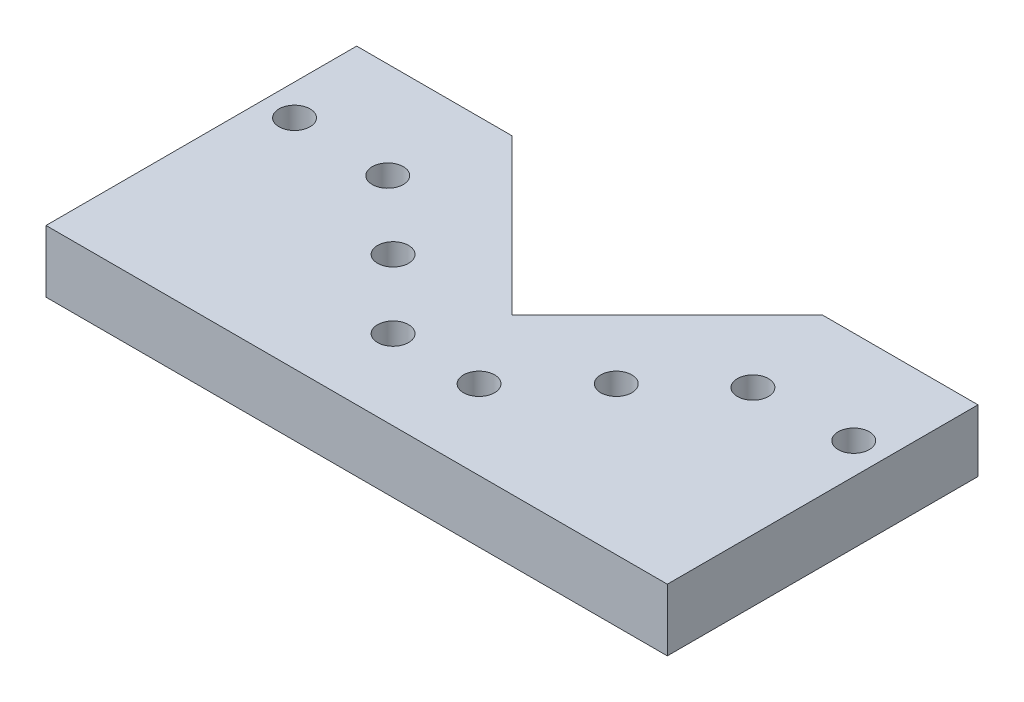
ISO-10303-21;
HEADER;
FILE_DESCRIPTION(('STEP AP214'),'2;1');
FILE_NAME('part.step','',(''),(''),'','','');
FILE_SCHEMA(('AUTOMOTIVE_DESIGN { 1 0 10303 214 1 1 1 1 }'));
ENDSEC;
DATA;
#1=APPLICATION_CONTEXT('core data for automotive mechanical design processes');
#2=APPLICATION_PROTOCOL_DEFINITION('international standard','automotive_design',2000,#1);
#3=PRODUCT_CONTEXT('',#1,'mechanical');
#4=PRODUCT('Part','Part','',(#3));
#5=PRODUCT_RELATED_PRODUCT_CATEGORY('part','',(#4));
#6=PRODUCT_DEFINITION_FORMATION('','',#4);
#7=PRODUCT_DEFINITION_CONTEXT('part definition',#1,'design');
#8=PRODUCT_DEFINITION('design','',#6,#7);
#9=PRODUCT_DEFINITION_SHAPE('','',#8);
#10=(LENGTH_UNIT() NAMED_UNIT(*) SI_UNIT(.MILLI.,.METRE.));
#11=(NAMED_UNIT(*) PLANE_ANGLE_UNIT() SI_UNIT($,.RADIAN.));
#12=(NAMED_UNIT(*) SI_UNIT($,.STERADIAN.) SOLID_ANGLE_UNIT());
#13=UNCERTAINTY_MEASURE_WITH_UNIT(LENGTH_MEASURE(1.E-05),#10,'distance_accuracy_value','');
#14=(GEOMETRIC_REPRESENTATION_CONTEXT(3) GLOBAL_UNCERTAINTY_ASSIGNED_CONTEXT((#13)) GLOBAL_UNIT_ASSIGNED_CONTEXT((#10,
#11,#12)) REPRESENTATION_CONTEXT('',''));
#15=CARTESIAN_POINT('',(0.,0.,0.));
#16=DIRECTION('',(0.,0.,1.));
#17=DIRECTION('',(1.,0.,0.));
#18=AXIS2_PLACEMENT_3D('',#15,#16,#17);
#19=CARTESIAN_POINT('',(0.,10.,0.));
#20=DIRECTION('',(-1.,0.,0.));
#21=DIRECTION('',(0.,0.,1.));
#22=AXIS2_PLACEMENT_3D('',#19,#20,#21);
#23=PLANE('',#22);
#24=DIRECTION('',(0.,0.,-1.));
#25=VECTOR('',#24,1.);
#26=CARTESIAN_POINT('',(0.,0.,0.));
#27=LINE('',#26,#25);
#28=CARTESIAN_POINT('',(0.,0.,0.));
#29=VERTEX_POINT('',#28);
#30=CARTESIAN_POINT('',(0.,0.,-50.));
#31=VERTEX_POINT('',#30);
#32=EDGE_CURVE('E95',#29,#31,#27,.T.);
#33=ORIENTED_EDGE('',*,*,#32,.T.);
#34=DIRECTION('',(0.,-1.,0.));
#35=VECTOR('',#34,1.);
#36=CARTESIAN_POINT('',(0.,10.,-50.));
#37=LINE('',#36,#35);
#38=CARTESIAN_POINT('',(0.,10.,-50.));
#39=VERTEX_POINT('',#38);
#40=EDGE_CURVE('E11',#39,#31,#37,.T.);
#41=ORIENTED_EDGE('',*,*,#40,.F.);
#42=DIRECTION('',(0.,0.,-1.));
#43=VECTOR('',#42,1.);
#44=CARTESIAN_POINT('',(0.,10.,0.));
#45=LINE('',#44,#43);
#46=CARTESIAN_POINT('',(0.,10.,0.));
#47=VERTEX_POINT('',#46);
#48=EDGE_CURVE('E125',#47,#39,#45,.T.);
#49=ORIENTED_EDGE('',*,*,#48,.F.);
#50=DIRECTION('',(0.,-1.,0.));
#51=VECTOR('',#50,1.);
#52=CARTESIAN_POINT('',(0.,10.,0.));
#53=LINE('',#52,#51);
#54=EDGE_CURVE('E108',#47,#29,#53,.T.);
#55=ORIENTED_EDGE('',*,*,#54,.T.);
#56=EDGE_LOOP('',(#33,#41,#49,#55));
#57=FACE_BOUND('',#56,.T.);
#58=ADVANCED_FACE('F33',(#57),#23,.F.);
#59=CARTESIAN_POINT('',(0.,10.,-50.));
#60=DIRECTION('',(0.,0.,1.));
#61=DIRECTION('',(1.,0.,0.));
#62=AXIS2_PLACEMENT_3D('',#59,#60,#61);
#63=PLANE('',#62);
#64=DIRECTION('',(-1.,0.,0.));
#65=VECTOR('',#64,1.);
#66=CARTESIAN_POINT('',(0.,0.,-50.));
#67=LINE('',#66,#65);
#68=CARTESIAN_POINT('',(-25.,0.,-50.));
#69=VERTEX_POINT('',#68);
#70=EDGE_CURVE('E91',#31,#69,#67,.T.);
#71=ORIENTED_EDGE('',*,*,#70,.T.);
#72=DIRECTION('',(0.,-1.,0.));
#73=VECTOR('',#72,1.);
#74=CARTESIAN_POINT('',(-25.,10.,-50.));
#75=LINE('',#74,#73);
#76=CARTESIAN_POINT('',(-25.,10.,-50.));
#77=VERTEX_POINT('',#76);
#78=EDGE_CURVE('E40',#77,#69,#75,.T.);
#79=ORIENTED_EDGE('',*,*,#78,.F.);
#80=DIRECTION('',(-1.,0.,0.));
#81=VECTOR('',#80,1.);
#82=CARTESIAN_POINT('',(0.,10.,-50.));
#83=LINE('',#82,#81);
#84=EDGE_CURVE('E104',#39,#77,#83,.T.);
#85=ORIENTED_EDGE('',*,*,#84,.F.);
#86=ORIENTED_EDGE('',*,*,#40,.T.);
#87=EDGE_LOOP('',(#71,#79,#85,#86));
#88=FACE_BOUND('',#87,.T.);
#89=ADVANCED_FACE('F103',(#88),#63,.F.);
#90=CARTESIAN_POINT('',(-50.,10.,-25.));
#91=DIRECTION('',(0.707106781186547,0.,0.707106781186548));
#92=DIRECTION('',(0.707106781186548,0.,-0.707106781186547));
#93=AXIS2_PLACEMENT_3D('',#90,#91,#92);
#94=PLANE('',#93);
#95=DIRECTION('',(-0.707106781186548,0.,0.707106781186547));
#96=VECTOR('',#95,1.);
#97=CARTESIAN_POINT('',(-50.,0.,-25.));
#98=LINE('',#97,#96);
#99=CARTESIAN_POINT('',(-50.,0.,-25.));
#100=VERTEX_POINT('',#99);
#101=EDGE_CURVE('E97',#69,#100,#98,.T.);
#102=ORIENTED_EDGE('',*,*,#101,.T.);
#103=DIRECTION('',(0.,-1.,0.));
#104=VECTOR('',#103,1.);
#105=CARTESIAN_POINT('',(-50.,10.,-25.));
#106=LINE('',#105,#104);
#107=CARTESIAN_POINT('',(-50.,10.,-25.));
#108=VERTEX_POINT('',#107);
#109=EDGE_CURVE('E146',#108,#100,#106,.T.);
#110=ORIENTED_EDGE('',*,*,#109,.F.);
#111=DIRECTION('',(-0.707106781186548,0.,0.707106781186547));
#112=VECTOR('',#111,1.);
#113=CARTESIAN_POINT('',(-50.,10.,-25.));
#114=LINE('',#113,#112);
#115=EDGE_CURVE('E128',#77,#108,#114,.T.);
#116=ORIENTED_EDGE('',*,*,#115,.F.);
#117=ORIENTED_EDGE('',*,*,#78,.T.);
#118=EDGE_LOOP('',(#102,#110,#116,#117));
#119=FACE_BOUND('',#118,.T.);
#120=ADVANCED_FACE('F150',(#119),#94,.F.);
#121=CARTESIAN_POINT('',(-75.,10.,-50.));
#122=DIRECTION('',(-0.707106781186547,0.,0.707106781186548));
#123=DIRECTION('',(0.707106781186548,0.,0.707106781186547));
#124=AXIS2_PLACEMENT_3D('',#121,#122,#123);
#125=PLANE('',#124);
#126=DIRECTION('',(-0.707106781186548,0.,-0.707106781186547));
#127=VECTOR('',#126,1.);
#128=CARTESIAN_POINT('',(-75.,0.,-50.));
#129=LINE('',#128,#127);
#130=CARTESIAN_POINT('',(-75.,0.,-50.));
#131=VERTEX_POINT('',#130);
#132=EDGE_CURVE('E117',#100,#131,#129,.T.);
#133=ORIENTED_EDGE('',*,*,#132,.T.);
#134=DIRECTION('',(0.,-1.,0.));
#135=VECTOR('',#134,1.);
#136=CARTESIAN_POINT('',(-75.,10.,-50.));
#137=LINE('',#136,#135);
#138=CARTESIAN_POINT('',(-75.,10.,-50.));
#139=VERTEX_POINT('',#138);
#140=EDGE_CURVE('E143',#139,#131,#137,.T.);
#141=ORIENTED_EDGE('',*,*,#140,.F.);
#142=DIRECTION('',(-0.707106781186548,0.,-0.707106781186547));
#143=VECTOR('',#142,1.);
#144=CARTESIAN_POINT('',(-75.,10.,-50.));
#145=LINE('',#144,#143);
#146=EDGE_CURVE('E130',#108,#139,#145,.T.);
#147=ORIENTED_EDGE('',*,*,#146,.F.);
#148=ORIENTED_EDGE('',*,*,#109,.T.);
#149=EDGE_LOOP('',(#133,#141,#147,#148));
#150=FACE_BOUND('',#149,.T.);
#151=ADVANCED_FACE('F158',(#150),#125,.F.);
#152=CARTESIAN_POINT('',(-75.,10.,-50.));
#153=DIRECTION('',(0.,0.,1.));
#154=DIRECTION('',(1.,0.,0.));
#155=AXIS2_PLACEMENT_3D('',#152,#153,#154);
#156=PLANE('',#155);
#157=DIRECTION('',(-1.,0.,0.));
#158=VECTOR('',#157,1.);
#159=CARTESIAN_POINT('',(-75.,0.,-50.));
#160=LINE('',#159,#158);
#161=CARTESIAN_POINT('',(-100.,0.,-50.));
#162=VERTEX_POINT('',#161);
#163=EDGE_CURVE('E119',#131,#162,#160,.T.);
#164=ORIENTED_EDGE('',*,*,#163,.T.);
#165=DIRECTION('',(0.,-1.,0.));
#166=VECTOR('',#165,1.);
#167=CARTESIAN_POINT('',(-100.,10.,-50.));
#168=LINE('',#167,#166);
#169=CARTESIAN_POINT('',(-100.,10.,-50.));
#170=VERTEX_POINT('',#169);
#171=EDGE_CURVE('E140',#170,#162,#168,.T.);
#172=ORIENTED_EDGE('',*,*,#171,.F.);
#173=DIRECTION('',(-1.,0.,0.));
#174=VECTOR('',#173,1.);
#175=CARTESIAN_POINT('',(-75.,10.,-50.));
#176=LINE('',#175,#174);
#177=EDGE_CURVE('E132',#139,#170,#176,.T.);
#178=ORIENTED_EDGE('',*,*,#177,.F.);
#179=ORIENTED_EDGE('',*,*,#140,.T.);
#180=EDGE_LOOP('',(#164,#172,#178,#179));
#181=FACE_BOUND('',#180,.T.);
#182=ADVANCED_FACE('F161',(#181),#156,.F.);
#183=CARTESIAN_POINT('',(-100.,10.,0.));
#184=DIRECTION('',(1.,0.,0.));
#185=DIRECTION('',(0.,0.,-1.));
#186=AXIS2_PLACEMENT_3D('',#183,#184,#185);
#187=PLANE('',#186);
#188=DIRECTION('',(0.,0.,1.));
#189=VECTOR('',#188,1.);
#190=CARTESIAN_POINT('',(-100.,0.,0.));
#191=LINE('',#190,#189);
#192=CARTESIAN_POINT('',(-100.,0.,0.));
#193=VERTEX_POINT('',#192);
#194=EDGE_CURVE('E121',#162,#193,#191,.T.);
#195=ORIENTED_EDGE('',*,*,#194,.T.);
#196=DIRECTION('',(0.,-1.,0.));
#197=VECTOR('',#196,1.);
#198=CARTESIAN_POINT('',(-100.,10.,0.));
#199=LINE('',#198,#197);
#200=CARTESIAN_POINT('',(-100.,10.,0.));
#201=VERTEX_POINT('',#200);
#202=EDGE_CURVE('E137',#201,#193,#199,.T.);
#203=ORIENTED_EDGE('',*,*,#202,.F.);
#204=DIRECTION('',(0.,0.,1.));
#205=VECTOR('',#204,1.);
#206=CARTESIAN_POINT('',(-100.,10.,0.));
#207=LINE('',#206,#205);
#208=EDGE_CURVE('E52',#170,#201,#207,.T.);
#209=ORIENTED_EDGE('',*,*,#208,.F.);
#210=ORIENTED_EDGE('',*,*,#171,.T.);
#211=EDGE_LOOP('',(#195,#203,#209,#210));
#212=FACE_BOUND('',#211,.T.);
#213=ADVANCED_FACE('F164',(#212),#187,.F.);
#214=CARTESIAN_POINT('',(0.,10.,0.));
#215=DIRECTION('',(0.,0.,-1.));
#216=DIRECTION('',(-1.,0.,0.));
#217=AXIS2_PLACEMENT_3D('',#214,#215,#216);
#218=PLANE('',#217);
#219=DIRECTION('',(1.,0.,0.));
#220=VECTOR('',#219,1.);
#221=CARTESIAN_POINT('',(0.,0.,0.));
#222=LINE('',#221,#220);
#223=EDGE_CURVE('E123',#193,#29,#222,.T.);
#224=ORIENTED_EDGE('',*,*,#223,.T.);
#225=ORIENTED_EDGE('',*,*,#54,.F.);
#226=DIRECTION('',(1.,0.,0.));
#227=VECTOR('',#226,1.);
#228=CARTESIAN_POINT('',(0.,10.,0.));
#229=LINE('',#228,#227);
#230=EDGE_CURVE('E47',#201,#47,#229,.T.);
#231=ORIENTED_EDGE('',*,*,#230,.F.);
#232=ORIENTED_EDGE('',*,*,#202,.T.);
#233=EDGE_LOOP('',(#224,#225,#231,#232));
#234=FACE_BOUND('',#233,.T.);
#235=ADVANCED_FACE('F166',(#234),#218,.F.);
#236=CARTESIAN_POINT('',(0.,10.,0.));
#237=DIRECTION('',(0.,1.,0.));
#238=DIRECTION('',(0.,0.,1.));
#239=AXIS2_PLACEMENT_3D('',#236,#237,#238);
#240=PLANE('',#239);
#241=CARTESIAN_POINT('',(-94.9999999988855,10.,-35.));
#242=DIRECTION('',(0.,1.,0.));
#243=DIRECTION('',(0.,0.,1.));
#244=AXIS2_PLACEMENT_3D('',#241,#242,#243);
#245=CIRCLE('',#244,2.5);
#246=CARTESIAN_POINT('',(-94.9999999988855,10.,-32.5));
#247=VERTEX_POINT('',#246);
#248=EDGE_CURVE('E305',#247,#247,#245,.T.);
#249=ORIENTED_EDGE('',*,*,#248,.F.);
#250=EDGE_LOOP('',(#249));
#251=FACE_BOUND('',#250,.T.);
#252=CARTESIAN_POINT('',(-79.4472083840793,10.,-34.4531381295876));
#253=DIRECTION('',(0.,1.,0.));
#254=DIRECTION('',(0.,0.,1.));
#255=AXIS2_PLACEMENT_3D('',#252,#253,#254);
#256=CIRCLE('',#255,2.5);
#257=CARTESIAN_POINT('',(-79.4472083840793,10.,-31.9531381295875));
#258=VERTEX_POINT('',#257);
#259=EDGE_CURVE('E307',#258,#258,#256,.T.);
#260=ORIENTED_EDGE('',*,*,#259,.F.);
#261=EDGE_LOOP('',(#260));
#262=FACE_BOUND('',#261,.T.);
#263=CARTESIAN_POINT('',(-68.0410341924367,10.,-23.8988985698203));
#264=DIRECTION('',(0.,1.,0.));
#265=DIRECTION('',(0.,0.,1.));
#266=AXIS2_PLACEMENT_3D('',#263,#264,#265);
#267=CIRCLE('',#266,2.5);
#268=CARTESIAN_POINT('',(-68.0410341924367,10.,-21.3988985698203));
#269=VERTEX_POINT('',#268);
#270=EDGE_CURVE('E315',#269,#269,#267,.T.);
#271=ORIENTED_EDGE('',*,*,#270,.F.);
#272=EDGE_LOOP('',(#271));
#273=FACE_BOUND('',#272,.T.);
#274=CARTESIAN_POINT('',(-56.9957691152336,10.,-12.8544010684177));
#275=DIRECTION('',(0.,1.,0.));
#276=DIRECTION('',(0.,0.,1.));
#277=AXIS2_PLACEMENT_3D('',#274,#275,#276);
#278=CIRCLE('',#277,2.5);
#279=CARTESIAN_POINT('',(-56.9957691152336,10.,-10.3544010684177));
#280=VERTEX_POINT('',#279);
#281=EDGE_CURVE('E321',#280,#280,#278,.T.);
#282=ORIENTED_EDGE('',*,*,#281,.F.);
#283=EDGE_LOOP('',(#282));
#284=FACE_BOUND('',#283,.T.);
#285=CARTESIAN_POINT('',(-43.0811324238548,10.,-12.7782831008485));
#286=DIRECTION('',(0.,1.,0.));
#287=DIRECTION('',(0.,0.,1.));
#288=AXIS2_PLACEMENT_3D('',#285,#286,#287);
#289=CIRCLE('',#288,2.5);
#290=CARTESIAN_POINT('',(-43.0811324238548,10.,-10.2782831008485));
#291=VERTEX_POINT('',#290);
#292=EDGE_CURVE('E327',#291,#291,#289,.T.);
#293=ORIENTED_EDGE('',*,*,#292,.F.);
#294=EDGE_LOOP('',(#293));
#295=FACE_BOUND('',#294,.T.);
#296=CARTESIAN_POINT('',(-32.0354331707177,10.,-23.8224312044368));
#297=DIRECTION('',(0.,1.,0.));
#298=DIRECTION('',(0.,0.,1.));
#299=AXIS2_PLACEMENT_3D('',#296,#297,#298);
#300=CIRCLE('',#299,2.5);
#301=CARTESIAN_POINT('',(-32.0354331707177,10.,-21.3224312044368));
#302=VERTEX_POINT('',#301);
#303=EDGE_CURVE('E333',#302,#302,#300,.T.);
#304=ORIENTED_EDGE('',*,*,#303,.F.);
#305=EDGE_LOOP('',(#304));
#306=FACE_BOUND('',#305,.T.);
#307=CARTESIAN_POINT('',(-20.518018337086,10.,-34.2904417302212));
#308=DIRECTION('',(0.,1.,0.));
#309=DIRECTION('',(0.,0.,1.));
#310=AXIS2_PLACEMENT_3D('',#307,#308,#309);
#311=CIRCLE('',#310,2.5);
#312=CARTESIAN_POINT('',(-20.518018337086,10.,-31.7904417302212));
#313=VERTEX_POINT('',#312);
#314=EDGE_CURVE('E339',#313,#313,#311,.T.);
#315=ORIENTED_EDGE('',*,*,#314,.F.);
#316=EDGE_LOOP('',(#315));
#317=FACE_BOUND('',#316,.T.);
#318=CARTESIAN_POINT('',(-5.,10.,-35.));
#319=DIRECTION('',(0.,1.,0.));
#320=DIRECTION('',(0.,0.,1.));
#321=AXIS2_PLACEMENT_3D('',#318,#319,#320);
#322=CIRCLE('',#321,2.5);
#323=CARTESIAN_POINT('',(-5.,10.,-32.5));
#324=VERTEX_POINT('',#323);
#325=EDGE_CURVE('E112',#324,#324,#322,.T.);
#326=ORIENTED_EDGE('',*,*,#325,.F.);
#327=EDGE_LOOP('',(#326));
#328=FACE_BOUND('',#327,.T.);
#329=ORIENTED_EDGE('',*,*,#48,.T.);
#330=ORIENTED_EDGE('',*,*,#84,.T.);
#331=ORIENTED_EDGE('',*,*,#115,.T.);
#332=ORIENTED_EDGE('',*,*,#146,.T.);
#333=ORIENTED_EDGE('',*,*,#177,.T.);
#334=ORIENTED_EDGE('',*,*,#208,.T.);
#335=ORIENTED_EDGE('',*,*,#230,.T.);
#336=EDGE_LOOP('',(#329,#330,#331,#332,#333,#334,#335));
#337=FACE_BOUND('',#336,.T.);
#338=ADVANCED_FACE('F153',(#251,#262,#273,#284,#295,#306,#317,#328,#337),#240,.T.);
#339=CARTESIAN_POINT('',(0.,0.,0.));
#340=DIRECTION('',(0.,1.,0.));
#341=DIRECTION('',(0.,0.,1.));
#342=AXIS2_PLACEMENT_3D('',#339,#340,#341);
#343=PLANE('',#342);
#344=CARTESIAN_POINT('',(-94.9999999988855,0.,-35.));
#345=DIRECTION('',(0.,1.,0.));
#346=DIRECTION('',(0.,0.,1.));
#347=AXIS2_PLACEMENT_3D('',#344,#345,#346);
#348=CIRCLE('',#347,2.5);
#349=CARTESIAN_POINT('',(-94.9999999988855,0.,-32.5));
#350=VERTEX_POINT('',#349);
#351=EDGE_CURVE('E302',#350,#350,#348,.T.);
#352=ORIENTED_EDGE('',*,*,#351,.T.);
#353=EDGE_LOOP('',(#352));
#354=FACE_BOUND('',#353,.T.);
#355=CARTESIAN_POINT('',(-79.4472083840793,0.,-34.4531381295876));
#356=DIRECTION('',(0.,1.,0.));
#357=DIRECTION('',(0.,0.,1.));
#358=AXIS2_PLACEMENT_3D('',#355,#356,#357);
#359=CIRCLE('',#358,2.5);
#360=CARTESIAN_POINT('',(-79.4472083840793,0.,-31.9531381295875));
#361=VERTEX_POINT('',#360);
#362=EDGE_CURVE('E312',#361,#361,#359,.T.);
#363=ORIENTED_EDGE('',*,*,#362,.T.);
#364=EDGE_LOOP('',(#363));
#365=FACE_BOUND('',#364,.T.);
#366=CARTESIAN_POINT('',(-68.0410341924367,0.,-23.8988985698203));
#367=DIRECTION('',(0.,1.,0.));
#368=DIRECTION('',(0.,0.,1.));
#369=AXIS2_PLACEMENT_3D('',#366,#367,#368);
#370=CIRCLE('',#369,2.5);
#371=CARTESIAN_POINT('',(-68.0410341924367,0.,-21.3988985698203));
#372=VERTEX_POINT('',#371);
#373=EDGE_CURVE('E318',#372,#372,#370,.T.);
#374=ORIENTED_EDGE('',*,*,#373,.T.);
#375=EDGE_LOOP('',(#374));
#376=FACE_BOUND('',#375,.T.);
#377=CARTESIAN_POINT('',(-56.9957691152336,0.,-12.8544010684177));
#378=DIRECTION('',(0.,1.,0.));
#379=DIRECTION('',(0.,0.,1.));
#380=AXIS2_PLACEMENT_3D('',#377,#378,#379);
#381=CIRCLE('',#380,2.5);
#382=CARTESIAN_POINT('',(-56.9957691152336,0.,-10.3544010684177));
#383=VERTEX_POINT('',#382);
#384=EDGE_CURVE('E324',#383,#383,#381,.T.);
#385=ORIENTED_EDGE('',*,*,#384,.T.);
#386=EDGE_LOOP('',(#385));
#387=FACE_BOUND('',#386,.T.);
#388=CARTESIAN_POINT('',(-43.0811324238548,0.,-12.7782831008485));
#389=DIRECTION('',(0.,1.,0.));
#390=DIRECTION('',(0.,0.,1.));
#391=AXIS2_PLACEMENT_3D('',#388,#389,#390);
#392=CIRCLE('',#391,2.5);
#393=CARTESIAN_POINT('',(-43.0811324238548,0.,-10.2782831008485));
#394=VERTEX_POINT('',#393);
#395=EDGE_CURVE('E330',#394,#394,#392,.T.);
#396=ORIENTED_EDGE('',*,*,#395,.T.);
#397=EDGE_LOOP('',(#396));
#398=FACE_BOUND('',#397,.T.);
#399=CARTESIAN_POINT('',(-32.0354331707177,0.,-23.8224312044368));
#400=DIRECTION('',(0.,1.,0.));
#401=DIRECTION('',(0.,0.,1.));
#402=AXIS2_PLACEMENT_3D('',#399,#400,#401);
#403=CIRCLE('',#402,2.5);
#404=CARTESIAN_POINT('',(-32.0354331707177,0.,-21.3224312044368));
#405=VERTEX_POINT('',#404);
#406=EDGE_CURVE('E336',#405,#405,#403,.T.);
#407=ORIENTED_EDGE('',*,*,#406,.T.);
#408=EDGE_LOOP('',(#407));
#409=FACE_BOUND('',#408,.T.);
#410=CARTESIAN_POINT('',(-20.518018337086,0.,-34.2904417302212));
#411=DIRECTION('',(0.,1.,0.));
#412=DIRECTION('',(0.,0.,1.));
#413=AXIS2_PLACEMENT_3D('',#410,#411,#412);
#414=CIRCLE('',#413,2.5);
#415=CARTESIAN_POINT('',(-20.518018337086,0.,-31.7904417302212));
#416=VERTEX_POINT('',#415);
#417=EDGE_CURVE('E342',#416,#416,#414,.T.);
#418=ORIENTED_EDGE('',*,*,#417,.T.);
#419=EDGE_LOOP('',(#418));
#420=FACE_BOUND('',#419,.T.);
#421=CARTESIAN_POINT('',(-5.,0.,-35.));
#422=DIRECTION('',(0.,1.,0.));
#423=DIRECTION('',(0.,0.,1.));
#424=AXIS2_PLACEMENT_3D('',#421,#422,#423);
#425=CIRCLE('',#424,2.5);
#426=CARTESIAN_POINT('',(-5.,0.,-32.5));
#427=VERTEX_POINT('',#426);
#428=EDGE_CURVE('E109',#427,#427,#425,.T.);
#429=ORIENTED_EDGE('',*,*,#428,.T.);
#430=EDGE_LOOP('',(#429));
#431=FACE_BOUND('',#430,.T.);
#432=ORIENTED_EDGE('',*,*,#32,.F.);
#433=ORIENTED_EDGE('',*,*,#223,.F.);
#434=ORIENTED_EDGE('',*,*,#194,.F.);
#435=ORIENTED_EDGE('',*,*,#163,.F.);
#436=ORIENTED_EDGE('',*,*,#132,.F.);
#437=ORIENTED_EDGE('',*,*,#101,.F.);
#438=ORIENTED_EDGE('',*,*,#70,.F.);
#439=EDGE_LOOP('',(#432,#433,#434,#435,#436,#437,#438));
#440=FACE_BOUND('',#439,.T.);
#441=ADVANCED_FACE('F92',(#354,#365,#376,#387,#398,#409,#420,#431,#440),#343,.F.);
#442=CARTESIAN_POINT('',(-5.,0.,-35.));
#443=DIRECTION('',(0.,1.,0.));
#444=DIRECTION('',(0.,0.,1.));
#445=AXIS2_PLACEMENT_3D('',#442,#443,#444);
#446=CYLINDRICAL_SURFACE('',#445,2.5);
#447=ORIENTED_EDGE('',*,*,#428,.F.);
#448=EDGE_LOOP('',(#447));
#449=FACE_BOUND('',#448,.T.);
#450=ORIENTED_EDGE('',*,*,#325,.T.);
#451=EDGE_LOOP('',(#450));
#452=FACE_BOUND('',#451,.T.);
#453=ADVANCED_FACE('F206',(#449,#452),#446,.F.);
#454=CARTESIAN_POINT('',(-20.518018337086,0.,-34.2904417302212));
#455=DIRECTION('',(0.,1.,0.));
#456=DIRECTION('',(0.,0.,1.));
#457=AXIS2_PLACEMENT_3D('',#454,#455,#456);
#458=CYLINDRICAL_SURFACE('',#457,2.5);
#459=ORIENTED_EDGE('',*,*,#417,.F.);
#460=EDGE_LOOP('',(#459));
#461=FACE_BOUND('',#460,.T.);
#462=ORIENTED_EDGE('',*,*,#314,.T.);
#463=EDGE_LOOP('',(#462));
#464=FACE_BOUND('',#463,.T.);
#465=ADVANCED_FACE('F211',(#461,#464),#458,.F.);
#466=CARTESIAN_POINT('',(-32.0354331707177,0.,-23.8224312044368));
#467=DIRECTION('',(0.,1.,0.));
#468=DIRECTION('',(0.,0.,1.));
#469=AXIS2_PLACEMENT_3D('',#466,#467,#468);
#470=CYLINDRICAL_SURFACE('',#469,2.5);
#471=ORIENTED_EDGE('',*,*,#406,.F.);
#472=EDGE_LOOP('',(#471));
#473=FACE_BOUND('',#472,.T.);
#474=ORIENTED_EDGE('',*,*,#303,.T.);
#475=EDGE_LOOP('',(#474));
#476=FACE_BOUND('',#475,.T.);
#477=ADVANCED_FACE('F235',(#473,#476),#470,.F.);
#478=CARTESIAN_POINT('',(-43.0811324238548,0.,-12.7782831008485));
#479=DIRECTION('',(0.,1.,0.));
#480=DIRECTION('',(0.,0.,1.));
#481=AXIS2_PLACEMENT_3D('',#478,#479,#480);
#482=CYLINDRICAL_SURFACE('',#481,2.5);
#483=ORIENTED_EDGE('',*,*,#395,.F.);
#484=EDGE_LOOP('',(#483));
#485=FACE_BOUND('',#484,.T.);
#486=ORIENTED_EDGE('',*,*,#292,.T.);
#487=EDGE_LOOP('',(#486));
#488=FACE_BOUND('',#487,.T.);
#489=ADVANCED_FACE('F245',(#485,#488),#482,.F.);
#490=CARTESIAN_POINT('',(-56.9957691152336,0.,-12.8544010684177));
#491=DIRECTION('',(0.,1.,0.));
#492=DIRECTION('',(0.,0.,1.));
#493=AXIS2_PLACEMENT_3D('',#490,#491,#492);
#494=CYLINDRICAL_SURFACE('',#493,2.5);
#495=ORIENTED_EDGE('',*,*,#384,.F.);
#496=EDGE_LOOP('',(#495));
#497=FACE_BOUND('',#496,.T.);
#498=ORIENTED_EDGE('',*,*,#281,.T.);
#499=EDGE_LOOP('',(#498));
#500=FACE_BOUND('',#499,.T.);
#501=ADVANCED_FACE('F255',(#497,#500),#494,.F.);
#502=CARTESIAN_POINT('',(-68.0410341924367,0.,-23.8988985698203));
#503=DIRECTION('',(0.,1.,0.));
#504=DIRECTION('',(0.,0.,1.));
#505=AXIS2_PLACEMENT_3D('',#502,#503,#504);
#506=CYLINDRICAL_SURFACE('',#505,2.5);
#507=ORIENTED_EDGE('',*,*,#373,.F.);
#508=EDGE_LOOP('',(#507));
#509=FACE_BOUND('',#508,.T.);
#510=ORIENTED_EDGE('',*,*,#270,.T.);
#511=EDGE_LOOP('',(#510));
#512=FACE_BOUND('',#511,.T.);
#513=ADVANCED_FACE('F265',(#509,#512),#506,.F.);
#514=CARTESIAN_POINT('',(-79.4472083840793,0.,-34.4531381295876));
#515=DIRECTION('',(0.,1.,0.));
#516=DIRECTION('',(0.,0.,1.));
#517=AXIS2_PLACEMENT_3D('',#514,#515,#516);
#518=CYLINDRICAL_SURFACE('',#517,2.5);
#519=ORIENTED_EDGE('',*,*,#362,.F.);
#520=EDGE_LOOP('',(#519));
#521=FACE_BOUND('',#520,.T.);
#522=ORIENTED_EDGE('',*,*,#259,.T.);
#523=EDGE_LOOP('',(#522));
#524=FACE_BOUND('',#523,.T.);
#525=ADVANCED_FACE('F275',(#521,#524),#518,.F.);
#526=CARTESIAN_POINT('',(-94.9999999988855,0.,-35.));
#527=DIRECTION('',(0.,1.,0.));
#528=DIRECTION('',(0.,0.,1.));
#529=AXIS2_PLACEMENT_3D('',#526,#527,#528);
#530=CYLINDRICAL_SURFACE('',#529,2.5);
#531=ORIENTED_EDGE('',*,*,#351,.F.);
#532=EDGE_LOOP('',(#531));
#533=FACE_BOUND('',#532,.T.);
#534=ORIENTED_EDGE('',*,*,#248,.T.);
#535=EDGE_LOOP('',(#534));
#536=FACE_BOUND('',#535,.T.);
#537=ADVANCED_FACE('F285',(#533,#536),#530,.F.);
#538=CLOSED_SHELL('',(#58,#89,#120,#151,#182,#213,#235,#338,#441,#453,#465,#477,#489,#501,#513,
#525,#537));
#539=MANIFOLD_SOLID_BREP('B2',#538);
#540=ADVANCED_BREP_SHAPE_REPRESENTATION('',(#18,#539),#14);
#541=SHAPE_DEFINITION_REPRESENTATION(#9,#540);
ENDSEC;
END-ISO-10303-21;
